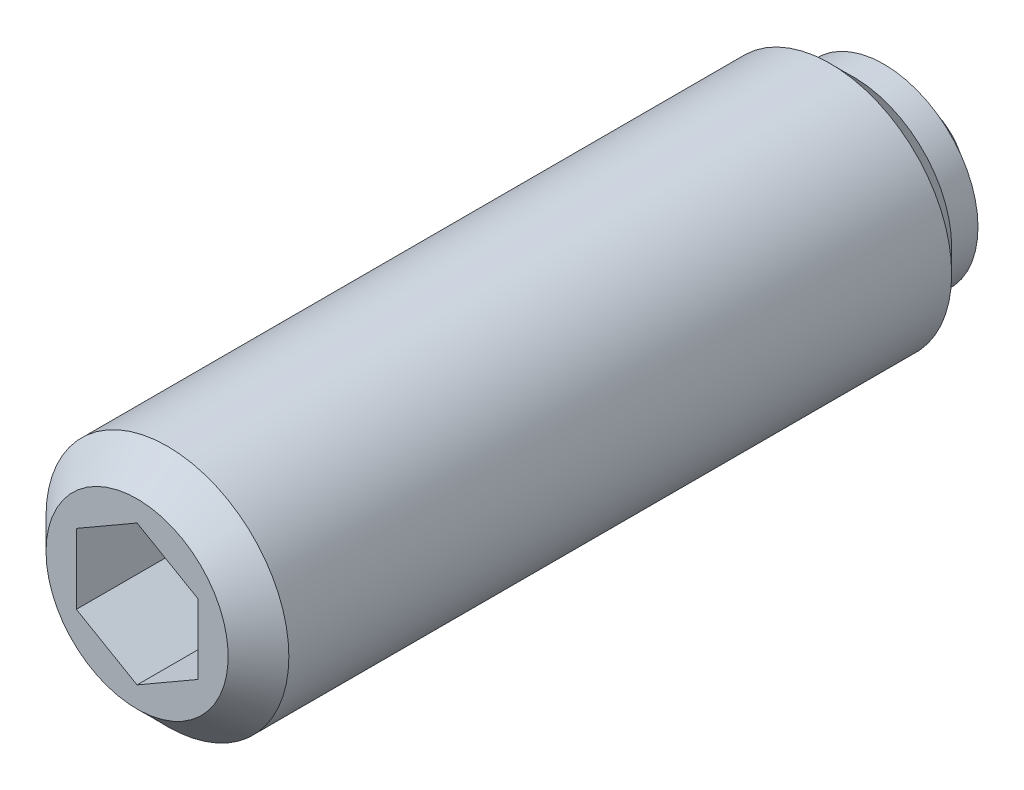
ISO-10303-21;
HEADER;
FILE_DESCRIPTION(('STEP AP214'),'2;1');
FILE_NAME('part.step','',(''),(''),'','','');
FILE_SCHEMA(('AUTOMOTIVE_DESIGN { 1 0 10303 214 1 1 1 1 }'));
ENDSEC;
DATA;
#1=APPLICATION_CONTEXT('core data for automotive mechanical design processes');
#2=APPLICATION_PROTOCOL_DEFINITION('international standard','automotive_design',2000,#1);
#3=PRODUCT_CONTEXT('',#1,'mechanical');
#4=PRODUCT('Part','Part','',(#3));
#5=PRODUCT_RELATED_PRODUCT_CATEGORY('part','',(#4));
#6=PRODUCT_DEFINITION_FORMATION('','',#4);
#7=PRODUCT_DEFINITION_CONTEXT('part definition',#1,'design');
#8=PRODUCT_DEFINITION('design','',#6,#7);
#9=PRODUCT_DEFINITION_SHAPE('','',#8);
#10=(LENGTH_UNIT() NAMED_UNIT(*) SI_UNIT(.MILLI.,.METRE.));
#11=(NAMED_UNIT(*) PLANE_ANGLE_UNIT() SI_UNIT($,.RADIAN.));
#12=(NAMED_UNIT(*) SI_UNIT($,.STERADIAN.) SOLID_ANGLE_UNIT());
#13=UNCERTAINTY_MEASURE_WITH_UNIT(LENGTH_MEASURE(1.E-05),#10,'distance_accuracy_value','');
#14=(GEOMETRIC_REPRESENTATION_CONTEXT(3) GLOBAL_UNCERTAINTY_ASSIGNED_CONTEXT((#13)) GLOBAL_UNIT_ASSIGNED_CONTEXT((#10,
#11,#12)) REPRESENTATION_CONTEXT('',''));
#15=CARTESIAN_POINT('',(0.,0.,0.));
#16=DIRECTION('',(0.,0.,1.));
#17=DIRECTION('',(1.,0.,0.));
#18=AXIS2_PLACEMENT_3D('',#15,#16,#17);
#19=CARTESIAN_POINT('',(0.,0.,23.2));
#20=DIRECTION('',(0.,0.,-1.));
#21=DIRECTION('',(-1.,0.,0.));
#22=AXIS2_PLACEMENT_3D('',#19,#20,#21);
#23=PLANE('',#22);
#24=DIRECTION('',(0.,1.,0.));
#25=VECTOR('',#24,1.);
#26=CARTESIAN_POINT('',(-2.,-1.15470053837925,23.2));
#27=LINE('',#26,#25);
#28=CARTESIAN_POINT('',(-2.,-1.15470053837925,23.2));
#29=VERTEX_POINT('',#28);
#30=CARTESIAN_POINT('',(-2.,1.15470053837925,23.2));
#31=VERTEX_POINT('',#30);
#32=EDGE_CURVE('E80',#29,#31,#27,.T.);
#33=ORIENTED_EDGE('',*,*,#32,.F.);
#34=DIRECTION('',(0.866025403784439,-0.5,0.));
#35=VECTOR('',#34,1.);
#36=CARTESIAN_POINT('',(0.,-2.3094010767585,23.2));
#37=LINE('',#36,#35);
#38=CARTESIAN_POINT('',(0.,-2.3094010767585,23.2));
#39=VERTEX_POINT('',#38);
#40=EDGE_CURVE('E102',#39,#29,#37,.F.);
#41=ORIENTED_EDGE('',*,*,#40,.F.);
#42=DIRECTION('',(-0.866025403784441,-0.5,0.));
#43=VECTOR('',#42,1.);
#44=CARTESIAN_POINT('',(1.,-1.73205080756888,23.2));
#45=LINE('',#44,#43);
#46=CARTESIAN_POINT('',(2.,-1.15470053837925,23.2));
#47=VERTEX_POINT('',#46);
#48=EDGE_CURVE('E81',#47,#39,#45,.T.);
#49=ORIENTED_EDGE('',*,*,#48,.F.);
#50=DIRECTION('',(0.,1.,0.));
#51=VECTOR('',#50,1.);
#52=CARTESIAN_POINT('',(2.,0.,23.2));
#53=LINE('',#52,#51);
#54=CARTESIAN_POINT('',(2.,1.15470053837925,23.2));
#55=VERTEX_POINT('',#54);
#56=EDGE_CURVE('E64',#55,#47,#53,.F.);
#57=ORIENTED_EDGE('',*,*,#56,.F.);
#58=DIRECTION('',(0.866025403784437,-0.5,0.));
#59=VECTOR('',#58,1.);
#60=CARTESIAN_POINT('',(1.,1.73205080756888,23.2));
#61=LINE('',#60,#59);
#62=CARTESIAN_POINT('',(0.,2.3094010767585,23.2));
#63=VERTEX_POINT('',#62);
#64=EDGE_CURVE('E67',#63,#55,#61,.T.);
#65=ORIENTED_EDGE('',*,*,#64,.F.);
#66=DIRECTION('',(0.866025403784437,0.5,0.));
#67=VECTOR('',#66,1.);
#68=CARTESIAN_POINT('',(-2.,1.15470053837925,23.2));
#69=LINE('',#68,#67);
#70=EDGE_CURVE('E69',#31,#63,#69,.T.);
#71=ORIENTED_EDGE('',*,*,#70,.F.);
#72=EDGE_LOOP('',(#33,#41,#49,#57,#65,#71));
#73=FACE_BOUND('',#72,.T.);
#74=ADVANCED_FACE('F14',(#73),#23,.F.);
#75=CARTESIAN_POINT('',(-2.,-1.15470053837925,23.2));
#76=DIRECTION('',(1.,0.,0.));
#77=DIRECTION('',(0.,0.,-1.));
#78=AXIS2_PLACEMENT_3D('',#75,#76,#77);
#79=PLANE('',#78);
#80=ORIENTED_EDGE('',*,*,#32,.T.);
#81=DIRECTION('',(0.,0.,-1.));
#82=VECTOR('',#81,1.);
#83=CARTESIAN_POINT('',(-2.,1.15470053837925,23.2));
#84=LINE('',#83,#82);
#85=CARTESIAN_POINT('',(-2.,1.15470053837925,26.2));
#86=VERTEX_POINT('',#85);
#87=EDGE_CURVE('E79',#86,#31,#84,.T.);
#88=ORIENTED_EDGE('',*,*,#87,.F.);
#89=DIRECTION('',(0.,1.,0.));
#90=VECTOR('',#89,1.);
#91=CARTESIAN_POINT('',(-2.,0.,26.2));
#92=LINE('',#91,#90);
#93=CARTESIAN_POINT('',(-2.,-1.15470053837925,26.2));
#94=VERTEX_POINT('',#93);
#95=EDGE_CURVE('E84',#86,#94,#92,.F.);
#96=ORIENTED_EDGE('',*,*,#95,.T.);
#97=DIRECTION('',(0.,0.,-1.));
#98=VECTOR('',#97,1.);
#99=CARTESIAN_POINT('',(-2.,-1.15470053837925,23.2));
#100=LINE('',#99,#98);
#101=EDGE_CURVE('E96',#29,#94,#100,.F.);
#102=ORIENTED_EDGE('',*,*,#101,.F.);
#103=EDGE_LOOP('',(#80,#88,#96,#102));
#104=FACE_BOUND('',#103,.T.);
#105=ADVANCED_FACE('F169',(#104),#79,.T.);
#106=CARTESIAN_POINT('',(0.,-2.3094010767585,23.2));
#107=DIRECTION('',(0.5,0.866025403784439,0.));
#108=DIRECTION('',(0.866025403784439,-0.5,0.));
#109=AXIS2_PLACEMENT_3D('',#106,#107,#108);
#110=PLANE('',#109);
#111=ORIENTED_EDGE('',*,*,#40,.T.);
#112=ORIENTED_EDGE('',*,*,#101,.T.);
#113=DIRECTION('',(0.866025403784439,-0.5,0.));
#114=VECTOR('',#113,1.);
#115=CARTESIAN_POINT('',(-2.,-1.15470053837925,26.2));
#116=LINE('',#115,#114);
#117=CARTESIAN_POINT('',(0.,-2.3094010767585,26.2));
#118=VERTEX_POINT('',#117);
#119=EDGE_CURVE('E85',#94,#118,#116,.T.);
#120=ORIENTED_EDGE('',*,*,#119,.T.);
#121=DIRECTION('',(0.,0.,-1.));
#122=VECTOR('',#121,1.);
#123=CARTESIAN_POINT('',(0.,-2.3094010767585,23.2));
#124=LINE('',#123,#122);
#125=EDGE_CURVE('E94',#39,#118,#124,.F.);
#126=ORIENTED_EDGE('',*,*,#125,.F.);
#127=EDGE_LOOP('',(#111,#112,#120,#126));
#128=FACE_BOUND('',#127,.T.);
#129=ADVANCED_FACE('F173',(#128),#110,.T.);
#130=CARTESIAN_POINT('',(2.,-1.15470053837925,23.2));
#131=DIRECTION('',(-0.5,0.866025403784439,0.));
#132=DIRECTION('',(0.866025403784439,0.5,0.));
#133=AXIS2_PLACEMENT_3D('',#130,#131,#132);
#134=PLANE('',#133);
#135=ORIENTED_EDGE('',*,*,#48,.T.);
#136=ORIENTED_EDGE('',*,*,#125,.T.);
#137=DIRECTION('',(0.866025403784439,0.5,0.));
#138=VECTOR('',#137,1.);
#139=CARTESIAN_POINT('',(0.,-2.3094010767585,26.2));
#140=LINE('',#139,#138);
#141=CARTESIAN_POINT('',(2.,-1.15470053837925,26.2));
#142=VERTEX_POINT('',#141);
#143=EDGE_CURVE('E108',#118,#142,#140,.T.);
#144=ORIENTED_EDGE('',*,*,#143,.T.);
#145=DIRECTION('',(0.,0.,1.));
#146=VECTOR('',#145,1.);
#147=CARTESIAN_POINT('',(2.,-1.15470053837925,23.2));
#148=LINE('',#147,#146);
#149=EDGE_CURVE('E91',#47,#142,#148,.T.);
#150=ORIENTED_EDGE('',*,*,#149,.F.);
#151=EDGE_LOOP('',(#135,#136,#144,#150));
#152=FACE_BOUND('',#151,.T.);
#153=ADVANCED_FACE('F178',(#152),#134,.T.);
#154=CARTESIAN_POINT('',(2.,1.15470053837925,23.2));
#155=DIRECTION('',(-1.,0.,0.));
#156=DIRECTION('',(0.,0.,1.));
#157=AXIS2_PLACEMENT_3D('',#154,#155,#156);
#158=PLANE('',#157);
#159=ORIENTED_EDGE('',*,*,#56,.T.);
#160=ORIENTED_EDGE('',*,*,#149,.T.);
#161=DIRECTION('',(0.,1.,0.));
#162=VECTOR('',#161,1.);
#163=CARTESIAN_POINT('',(2.,0.,26.2));
#164=LINE('',#163,#162);
#165=CARTESIAN_POINT('',(2.,1.15470053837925,26.2));
#166=VERTEX_POINT('',#165);
#167=EDGE_CURVE('E110',#142,#166,#164,.T.);
#168=ORIENTED_EDGE('',*,*,#167,.T.);
#169=DIRECTION('',(0.,0.,-1.));
#170=VECTOR('',#169,1.);
#171=CARTESIAN_POINT('',(2.,1.15470053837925,23.2));
#172=LINE('',#171,#170);
#173=EDGE_CURVE('E87',#55,#166,#172,.F.);
#174=ORIENTED_EDGE('',*,*,#173,.F.);
#175=EDGE_LOOP('',(#159,#160,#168,#174));
#176=FACE_BOUND('',#175,.T.);
#177=ADVANCED_FACE('F184',(#176),#158,.T.);
#178=CARTESIAN_POINT('',(0.,2.3094010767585,23.2));
#179=DIRECTION('',(-0.5,-0.866025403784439,0.));
#180=DIRECTION('',(-0.866025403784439,0.5,0.));
#181=AXIS2_PLACEMENT_3D('',#178,#179,#180);
#182=PLANE('',#181);
#183=ORIENTED_EDGE('',*,*,#64,.T.);
#184=ORIENTED_EDGE('',*,*,#173,.T.);
#185=DIRECTION('',(-0.866025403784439,0.5,0.));
#186=VECTOR('',#185,1.);
#187=CARTESIAN_POINT('',(2.,1.15470053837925,26.2));
#188=LINE('',#187,#186);
#189=CARTESIAN_POINT('',(0.,2.3094010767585,26.2));
#190=VERTEX_POINT('',#189);
#191=EDGE_CURVE('E31',#166,#190,#188,.T.);
#192=ORIENTED_EDGE('',*,*,#191,.T.);
#193=DIRECTION('',(0.,0.,-1.));
#194=VECTOR('',#193,1.);
#195=CARTESIAN_POINT('',(0.,2.3094010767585,23.2));
#196=LINE('',#195,#194);
#197=EDGE_CURVE('E77',#63,#190,#196,.F.);
#198=ORIENTED_EDGE('',*,*,#197,.F.);
#199=EDGE_LOOP('',(#183,#184,#192,#198));
#200=FACE_BOUND('',#199,.T.);
#201=ADVANCED_FACE('F83',(#200),#182,.T.);
#202=CARTESIAN_POINT('',(-2.,1.15470053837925,23.2));
#203=DIRECTION('',(0.5,-0.866025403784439,0.));
#204=DIRECTION('',(-0.866025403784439,-0.5,0.));
#205=AXIS2_PLACEMENT_3D('',#202,#203,#204);
#206=PLANE('',#205);
#207=ORIENTED_EDGE('',*,*,#70,.T.);
#208=ORIENTED_EDGE('',*,*,#197,.T.);
#209=DIRECTION('',(-0.866025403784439,-0.5,0.));
#210=VECTOR('',#209,1.);
#211=CARTESIAN_POINT('',(0.,2.3094010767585,26.2));
#212=LINE('',#211,#210);
#213=EDGE_CURVE('E113',#190,#86,#212,.T.);
#214=ORIENTED_EDGE('',*,*,#213,.T.);
#215=ORIENTED_EDGE('',*,*,#87,.T.);
#216=EDGE_LOOP('',(#207,#208,#214,#215));
#217=FACE_BOUND('',#216,.T.);
#218=ADVANCED_FACE('F75',(#217),#206,.T.);
#219=CARTESIAN_POINT('',(0.,0.,26.2));
#220=DIRECTION('',(0.,0.,-1.));
#221=DIRECTION('',(-1.,0.,0.));
#222=AXIS2_PLACEMENT_3D('',#219,#220,#221);
#223=PLANE('',#222);
#224=ORIENTED_EDGE('',*,*,#191,.F.);
#225=ORIENTED_EDGE('',*,*,#167,.F.);
#226=ORIENTED_EDGE('',*,*,#143,.F.);
#227=ORIENTED_EDGE('',*,*,#119,.F.);
#228=ORIENTED_EDGE('',*,*,#95,.F.);
#229=ORIENTED_EDGE('',*,*,#213,.F.);
#230=EDGE_LOOP('',(#224,#225,#226,#227,#228,#229));
#231=FACE_BOUND('',#230,.T.);
#232=CARTESIAN_POINT('',(0.,0.,26.1999999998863));
#233=DIRECTION('',(0.,0.,-1.));
#234=DIRECTION('',(-1.,0.,0.));
#235=AXIS2_PLACEMENT_3D('',#232,#233,#234);
#236=CIRCLE('',#235,2.99999999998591);
#237=CARTESIAN_POINT('',(-2.99999999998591,0.,26.1999999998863));
#238=VERTEX_POINT('',#237);
#239=EDGE_CURVE('E17',#238,#238,#236,.T.);
#240=ORIENTED_EDGE('',*,*,#239,.F.);
#241=EDGE_LOOP('',(#240));
#242=FACE_BOUND('',#241,.T.);
#243=ADVANCED_FACE('F193',(#231,#242),#223,.F.);
#244=CARTESIAN_POINT('',(0.,0.,25.2000000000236));
#245=DIRECTION('',(0.,0.,-1.));
#246=DIRECTION('',(-1.,0.,0.));
#247=AXIS2_PLACEMENT_3D('',#244,#245,#246);
#248=CONICAL_SURFACE('',#247,3.99999999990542,0.785398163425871);
#249=ORIENTED_EDGE('',*,*,#239,.T.);
#250=EDGE_LOOP('',(#249));
#251=FACE_BOUND('',#250,.T.);
#252=CARTESIAN_POINT('',(0.,0.,25.2));
#253=DIRECTION('',(0.,0.,1.));
#254=DIRECTION('',(1.,0.,0.));
#255=AXIS2_PLACEMENT_3D('',#252,#253,#254);
#256=CIRCLE('',#255,4.);
#257=CARTESIAN_POINT('',(4.,0.,25.2));
#258=VERTEX_POINT('',#257);
#259=EDGE_CURVE('E9',#258,#258,#256,.F.);
#260=ORIENTED_EDGE('',*,*,#259,.F.);
#261=EDGE_LOOP('',(#260));
#262=FACE_BOUND('',#261,.T.);
#263=ADVANCED_FACE('F165',(#251,#262),#248,.T.);
#264=CARTESIAN_POINT('',(0.,0.,16.6));
#265=DIRECTION('',(0.,0.,1.));
#266=DIRECTION('',(1.,0.,0.));
#267=AXIS2_PLACEMENT_3D('',#264,#265,#266);
#268=CYLINDRICAL_SURFACE('',#267,4.);
#269=ORIENTED_EDGE('',*,*,#259,.T.);
#270=EDGE_LOOP('',(#269));
#271=FACE_BOUND('',#270,.T.);
#272=CARTESIAN_POINT('',(0.,0.,3.36700000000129));
#273=DIRECTION('',(0.,0.,1.));
#274=DIRECTION('',(1.,0.,0.));
#275=AXIS2_PLACEMENT_3D('',#272,#273,#274);
#276=CIRCLE('',#275,4.);
#277=CARTESIAN_POINT('',(4.,0.,3.36700000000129));
#278=VERTEX_POINT('',#277);
#279=EDGE_CURVE('E128',#278,#278,#276,.T.);
#280=ORIENTED_EDGE('',*,*,#279,.T.);
#281=EDGE_LOOP('',(#280));
#282=FACE_BOUND('',#281,.T.);
#283=ADVANCED_FACE('F132',(#271,#282),#268,.T.);
#284=CARTESIAN_POINT('',(0.,0.,2.75));
#285=DIRECTION('',(0.,0.,1.));
#286=DIRECTION('',(0.,1.,0.));
#287=AXIS2_PLACEMENT_3D('',#284,#285,#286);
#288=SPHERICAL_SURFACE('',#287,2.75);
#289=CARTESIAN_POINT('',(0.,0.,1.6));
#290=DIRECTION('',(0.,0.,1.));
#291=DIRECTION('',(1.,0.,0.));
#292=AXIS2_PLACEMENT_3D('',#289,#290,#291);
#293=CIRCLE('',#292,2.49799919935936);
#294=CARTESIAN_POINT('',(2.49799919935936,0.,1.6));
#295=VERTEX_POINT('',#294);
#296=EDGE_CURVE('E71',#295,#295,#293,.T.);
#297=ORIENTED_EDGE('',*,*,#296,.F.);
#298=EDGE_LOOP('',(#297));
#299=FACE_BOUND('',#298,.T.);
#300=ADVANCED_FACE('F155',(#299),#288,.T.);
#301=CARTESIAN_POINT('',(0.,2.49799919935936,1.6));
#302=DIRECTION('',(0.,0.,1.));
#303=DIRECTION('',(1.,0.,0.));
#304=AXIS2_PLACEMENT_3D('',#301,#302,#303);
#305=PLANE('',#304);
#306=CARTESIAN_POINT('',(0.,0.,1.6));
#307=DIRECTION('',(0.,0.,1.));
#308=DIRECTION('',(1.,0.,0.));
#309=AXIS2_PLACEMENT_3D('',#306,#307,#308);
#310=CIRCLE('',#309,3.10000000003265);
#311=CARTESIAN_POINT('',(3.10000000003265,0.,1.6));
#312=VERTEX_POINT('',#311);
#313=EDGE_CURVE('E119',#312,#312,#310,.T.);
#314=ORIENTED_EDGE('',*,*,#313,.F.);
#315=EDGE_LOOP('',(#314));
#316=FACE_BOUND('',#315,.T.);
#317=ORIENTED_EDGE('',*,*,#296,.T.);
#318=EDGE_LOOP('',(#317));
#319=FACE_BOUND('',#318,.T.);
#320=ADVANCED_FACE('F149',(#316,#319),#305,.F.);
#321=CARTESIAN_POINT('',(0.,0.,29.478518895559));
#322=DIRECTION('',(0.,0.,1.));
#323=DIRECTION('',(1.,0.,0.));
#324=AXIS2_PLACEMENT_3D('',#321,#322,#323);
#325=CYLINDRICAL_SURFACE('',#324,3.10000000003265);
#326=CARTESIAN_POINT('',(0.,0.,2.6));
#327=DIRECTION('',(0.,0.,1.));
#328=DIRECTION('',(1.,0.,0.));
#329=AXIS2_PLACEMENT_3D('',#326,#327,#328);
#330=CIRCLE('',#329,3.10000000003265);
#331=CARTESIAN_POINT('',(3.10000000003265,0.,2.6));
#332=VERTEX_POINT('',#331);
#333=EDGE_CURVE('E122',#332,#332,#330,.T.);
#334=ORIENTED_EDGE('',*,*,#333,.F.);
#335=EDGE_LOOP('',(#334));
#336=FACE_BOUND('',#335,.T.);
#337=ORIENTED_EDGE('',*,*,#313,.T.);
#338=EDGE_LOOP('',(#337));
#339=FACE_BOUND('',#338,.T.);
#340=ADVANCED_FACE('F143',(#336,#339),#325,.T.);
#341=CARTESIAN_POINT('',(0.,3.10000000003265,2.6));
#342=DIRECTION('',(0.,0.,1.));
#343=DIRECTION('',(1.,0.,0.));
#344=AXIS2_PLACEMENT_3D('',#341,#342,#343);
#345=PLANE('',#344);
#346=CARTESIAN_POINT('',(0.,0.,2.6));
#347=DIRECTION('',(0.,0.,1.));
#348=DIRECTION('',(1.,0.,0.));
#349=AXIS2_PLACEMENT_3D('',#346,#347,#348);
#350=CIRCLE('',#349,3.23299999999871);
#351=CARTESIAN_POINT('',(3.23299999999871,0.,2.6));
#352=VERTEX_POINT('',#351);
#353=EDGE_CURVE('E125',#352,#352,#350,.T.);
#354=ORIENTED_EDGE('',*,*,#353,.F.);
#355=EDGE_LOOP('',(#354));
#356=FACE_BOUND('',#355,.T.);
#357=ORIENTED_EDGE('',*,*,#333,.T.);
#358=EDGE_LOOP('',(#357));
#359=FACE_BOUND('',#358,.T.);
#360=ADVANCED_FACE('F137',(#356,#359),#345,.F.);
#361=CARTESIAN_POINT('',(0.,0.,2.6));
#362=DIRECTION('',(0.,0.,1.));
#363=DIRECTION('',(1.,0.,0.));
#364=AXIS2_PLACEMENT_3D('',#361,#362,#363);
#365=CONICAL_SURFACE('',#364,3.23299999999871,0.785398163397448);
#366=ORIENTED_EDGE('',*,*,#279,.F.);
#367=EDGE_LOOP('',(#366));
#368=FACE_BOUND('',#367,.T.);
#369=ORIENTED_EDGE('',*,*,#353,.T.);
#370=EDGE_LOOP('',(#369));
#371=FACE_BOUND('',#370,.T.);
#372=ADVANCED_FACE('F134',(#368,#371),#365,.T.);
#373=CLOSED_SHELL('',(#74,#105,#129,#153,#177,#201,#218,#243,#263,#283,#300,#320,#340,#360,#372));
#374=MANIFOLD_SOLID_BREP('B1',#373);
#375=ADVANCED_BREP_SHAPE_REPRESENTATION('',(#18,#374),#14);
#376=SHAPE_DEFINITION_REPRESENTATION(#9,#375);
ENDSEC;
END-ISO-10303-21;
